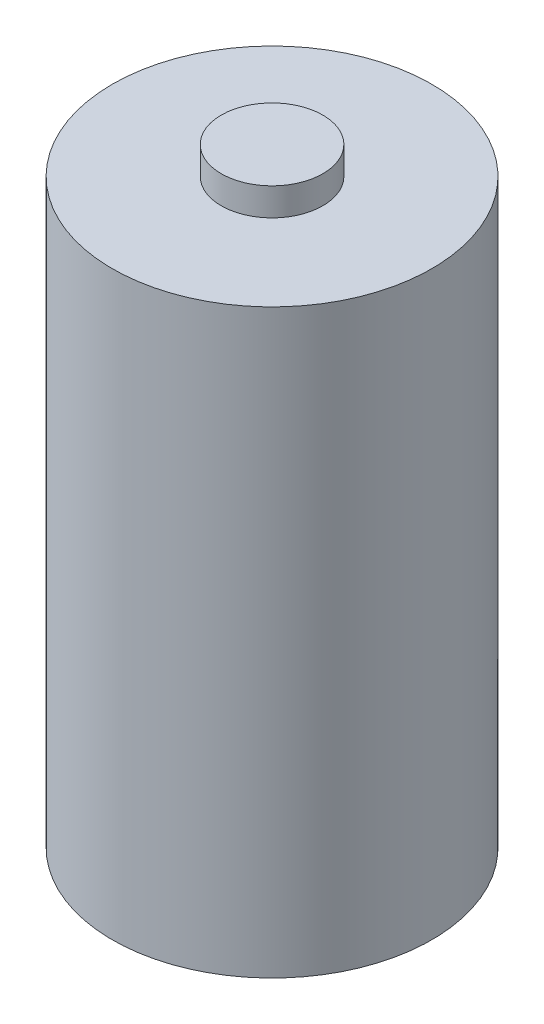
ISO-10303-21;
HEADER;
FILE_DESCRIPTION(('STEP AP214'),'2;1');
FILE_NAME('part.step','',(''),(''),'','','');
FILE_SCHEMA(('AUTOMOTIVE_DESIGN { 1 0 10303 214 1 1 1 1 }'));
ENDSEC;
DATA;
#1=APPLICATION_CONTEXT('core data for automotive mechanical design processes');
#2=APPLICATION_PROTOCOL_DEFINITION('international standard','automotive_design',2000,#1);
#3=PRODUCT_CONTEXT('',#1,'mechanical');
#4=PRODUCT('Part','Part','',(#3));
#5=PRODUCT_RELATED_PRODUCT_CATEGORY('part','',(#4));
#6=PRODUCT_DEFINITION_FORMATION('','',#4);
#7=PRODUCT_DEFINITION_CONTEXT('part definition',#1,'design');
#8=PRODUCT_DEFINITION('design','',#6,#7);
#9=PRODUCT_DEFINITION_SHAPE('','',#8);
#10=(LENGTH_UNIT() NAMED_UNIT(*) SI_UNIT(.MILLI.,.METRE.));
#11=(NAMED_UNIT(*) PLANE_ANGLE_UNIT() SI_UNIT($,.RADIAN.));
#12=(NAMED_UNIT(*) SI_UNIT($,.STERADIAN.) SOLID_ANGLE_UNIT());
#13=UNCERTAINTY_MEASURE_WITH_UNIT(LENGTH_MEASURE(1.E-05),#10,'distance_accuracy_value','');
#14=(GEOMETRIC_REPRESENTATION_CONTEXT(3) GLOBAL_UNCERTAINTY_ASSIGNED_CONTEXT((#13)) GLOBAL_UNIT_ASSIGNED_CONTEXT((#10,
#11,#12)) REPRESENTATION_CONTEXT('',''));
#15=CARTESIAN_POINT('',(0.,0.,0.));
#16=DIRECTION('',(0.,0.,1.));
#17=DIRECTION('',(1.,0.,0.));
#18=AXIS2_PLACEMENT_3D('',#15,#16,#17);
#19=CARTESIAN_POINT('',(0.,0.,0.));
#20=DIRECTION('',(0.,1.,0.));
#21=DIRECTION('',(-1.,0.,0.));
#22=AXIS2_PLACEMENT_3D('',#19,#20,#21);
#23=PLANE('',#22);
#24=CARTESIAN_POINT('',(0.,0.,0.));
#25=DIRECTION('',(0.,1.,0.));
#26=DIRECTION('',(-1.,0.,0.));
#27=AXIS2_PLACEMENT_3D('',#24,#25,#26);
#28=CIRCLE('',#27,15.494);
#29=CARTESIAN_POINT('',(-15.494,0.,0.));
#30=VERTEX_POINT('',#29);
#31=EDGE_CURVE('E12',#30,#30,#28,.T.);
#32=ORIENTED_EDGE('',*,*,#31,.F.);
#33=EDGE_LOOP('',(#32));
#34=FACE_BOUND('',#33,.T.);
#35=ADVANCED_FACE('F40',(#34),#23,.F.);
#36=CARTESIAN_POINT('',(0.,70.0316129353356,0.));
#37=DIRECTION('',(0.,1.,0.));
#38=DIRECTION('',(-1.,0.,0.));
#39=AXIS2_PLACEMENT_3D('',#36,#37,#38);
#40=CYLINDRICAL_SURFACE('',#39,15.494);
#41=CARTESIAN_POINT('',(0.,56.3626000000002,0.));
#42=DIRECTION('',(0.,1.,0.));
#43=DIRECTION('',(-1.,0.,0.));
#44=AXIS2_PLACEMENT_3D('',#41,#42,#43);
#45=CIRCLE('',#44,15.494);
#46=CARTESIAN_POINT('',(-15.494,56.3626000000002,0.));
#47=VERTEX_POINT('',#46);
#48=EDGE_CURVE('E46',#47,#47,#45,.T.);
#49=ORIENTED_EDGE('',*,*,#48,.F.);
#50=EDGE_LOOP('',(#49));
#51=FACE_BOUND('',#50,.T.);
#52=ORIENTED_EDGE('',*,*,#31,.T.);
#53=EDGE_LOOP('',(#52));
#54=FACE_BOUND('',#53,.T.);
#55=ADVANCED_FACE('F70',(#51,#54),#40,.T.);
#56=CARTESIAN_POINT('',(15.494,56.3626000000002,0.));
#57=DIRECTION('',(0.,-1.,0.));
#58=DIRECTION('',(1.,0.,0.));
#59=AXIS2_PLACEMENT_3D('',#56,#57,#58);
#60=PLANE('',#59);
#61=CARTESIAN_POINT('',(0.,56.3626000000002,0.));
#62=DIRECTION('',(0.,1.,0.));
#63=DIRECTION('',(-1.,0.,0.));
#64=AXIS2_PLACEMENT_3D('',#61,#62,#63);
#65=CIRCLE('',#64,4.9276);
#66=CARTESIAN_POINT('',(-4.92759999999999,56.3626000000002,0.));
#67=VERTEX_POINT('',#66);
#68=EDGE_CURVE('E50',#67,#67,#65,.T.);
#69=ORIENTED_EDGE('',*,*,#68,.F.);
#70=EDGE_LOOP('',(#69));
#71=FACE_BOUND('',#70,.T.);
#72=ORIENTED_EDGE('',*,*,#48,.T.);
#73=EDGE_LOOP('',(#72));
#74=FACE_BOUND('',#73,.T.);
#75=ADVANCED_FACE('F65',(#71,#74),#60,.F.);
#76=CARTESIAN_POINT('',(0.,70.0316129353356,0.));
#77=DIRECTION('',(0.,1.,0.));
#78=DIRECTION('',(-1.,0.,0.));
#79=AXIS2_PLACEMENT_3D('',#76,#77,#78);
#80=CYLINDRICAL_SURFACE('',#79,4.9276);
#81=CARTESIAN_POINT('',(0.,59.055,0.));
#82=DIRECTION('',(0.,1.,0.));
#83=DIRECTION('',(-1.,0.,0.));
#84=AXIS2_PLACEMENT_3D('',#81,#82,#83);
#85=CIRCLE('',#84,4.9276);
#86=CARTESIAN_POINT('',(-4.92760000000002,59.055,0.));
#87=VERTEX_POINT('',#86);
#88=EDGE_CURVE('E54',#87,#87,#85,.T.);
#89=ORIENTED_EDGE('',*,*,#88,.F.);
#90=EDGE_LOOP('',(#89));
#91=FACE_BOUND('',#90,.T.);
#92=ORIENTED_EDGE('',*,*,#68,.T.);
#93=EDGE_LOOP('',(#92));
#94=FACE_BOUND('',#93,.T.);
#95=ADVANCED_FACE('F62',(#91,#94),#80,.T.);
#96=CARTESIAN_POINT('',(4.92759999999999,59.055,0.));
#97=DIRECTION('',(0.,-1.,0.));
#98=DIRECTION('',(1.,0.,0.));
#99=AXIS2_PLACEMENT_3D('',#96,#97,#98);
#100=PLANE('',#99);
#101=ORIENTED_EDGE('',*,*,#88,.T.);
#102=EDGE_LOOP('',(#101));
#103=FACE_BOUND('',#102,.T.);
#104=ADVANCED_FACE('F60',(#103),#100,.F.);
#105=CLOSED_SHELL('',(#35,#55,#75,#95,#104));
#106=MANIFOLD_SOLID_BREP('B2',#105);
#107=ADVANCED_BREP_SHAPE_REPRESENTATION('',(#18,#106),#14);
#108=SHAPE_DEFINITION_REPRESENTATION(#9,#107);
ENDSEC;
END-ISO-10303-21;
